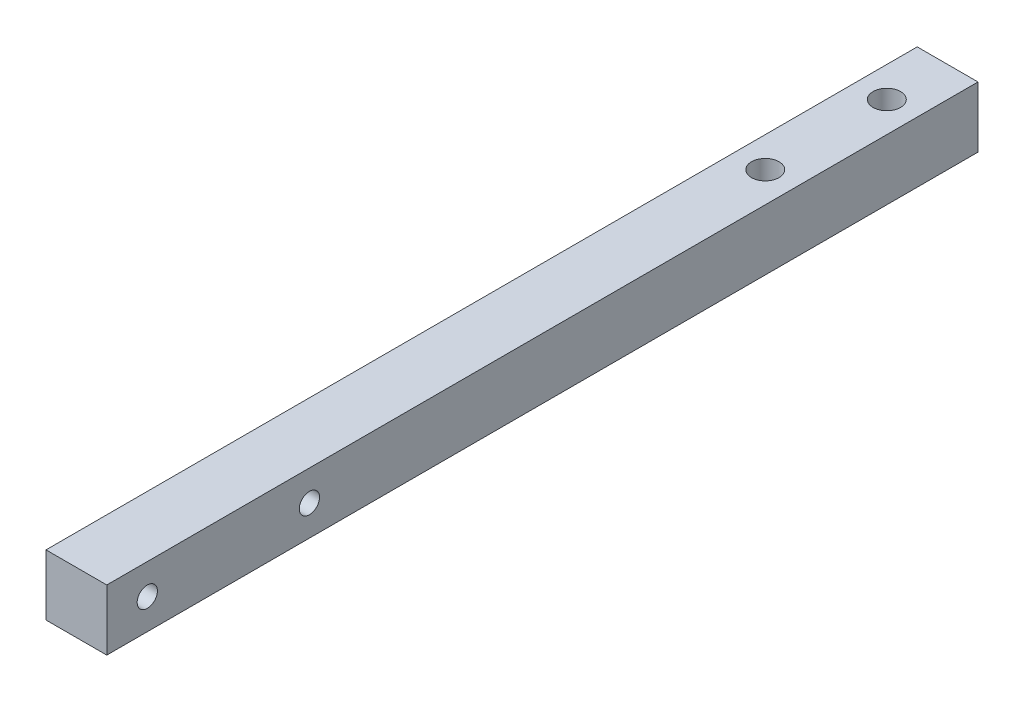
ISO-10303-21;
HEADER;
FILE_DESCRIPTION(('STEP AP214'),'2;1');
FILE_NAME('part.step','',(''),(''),'','','');
FILE_SCHEMA(('AUTOMOTIVE_DESIGN { 1 0 10303 214 1 1 1 1 }'));
ENDSEC;
DATA;
#1=APPLICATION_CONTEXT('core data for automotive mechanical design processes');
#2=APPLICATION_PROTOCOL_DEFINITION('international standard','automotive_design',2000,#1);
#3=PRODUCT_CONTEXT('',#1,'mechanical');
#4=PRODUCT('Part','Part','',(#3));
#5=PRODUCT_RELATED_PRODUCT_CATEGORY('part','',(#4));
#6=PRODUCT_DEFINITION_FORMATION('','',#4);
#7=PRODUCT_DEFINITION_CONTEXT('part definition',#1,'design');
#8=PRODUCT_DEFINITION('design','',#6,#7);
#9=PRODUCT_DEFINITION_SHAPE('','',#8);
#10=(LENGTH_UNIT() NAMED_UNIT(*) SI_UNIT(.MILLI.,.METRE.));
#11=(NAMED_UNIT(*) PLANE_ANGLE_UNIT() SI_UNIT($,.RADIAN.));
#12=(NAMED_UNIT(*) SI_UNIT($,.STERADIAN.) SOLID_ANGLE_UNIT());
#13=UNCERTAINTY_MEASURE_WITH_UNIT(LENGTH_MEASURE(1.E-05),#10,'distance_accuracy_value','');
#14=(GEOMETRIC_REPRESENTATION_CONTEXT(3) GLOBAL_UNCERTAINTY_ASSIGNED_CONTEXT((#13)) GLOBAL_UNIT_ASSIGNED_CONTEXT((#10,
#11,#12)) REPRESENTATION_CONTEXT('',''));
#15=CARTESIAN_POINT('',(0.,0.,0.));
#16=DIRECTION('',(0.,0.,1.));
#17=DIRECTION('',(1.,0.,0.));
#18=AXIS2_PLACEMENT_3D('',#15,#16,#17);
#19=CARTESIAN_POINT('',(-4.71844785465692E-13,-1.88737914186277E-12,215.));
#20=DIRECTION('',(1.,0.,0.));
#21=DIRECTION('',(0.,0.,-1.));
#22=AXIS2_PLACEMENT_3D('',#19,#20,#21);
#23=PLANE('',#22);
#24=CARTESIAN_POINT('',(-4.71844785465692E-13,7.50000000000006,165.));
#25=DIRECTION('',(1.,0.,0.));
#26=DIRECTION('',(0.,0.,-1.));
#27=AXIS2_PLACEMENT_3D('',#24,#25,#26);
#28=CIRCLE('',#27,2.5);
#29=CARTESIAN_POINT('',(-4.71844785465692E-13,7.50000000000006,162.5));
#30=VERTEX_POINT('',#29);
#31=EDGE_CURVE('E153',#30,#30,#28,.T.);
#32=ORIENTED_EDGE('',*,*,#31,.T.);
#33=EDGE_LOOP('',(#32));
#34=FACE_BOUND('',#33,.T.);
#35=CARTESIAN_POINT('',(-4.71844785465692E-13,7.49999999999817,205.));
#36=DIRECTION('',(1.,0.,0.));
#37=DIRECTION('',(0.,0.,-1.));
#38=AXIS2_PLACEMENT_3D('',#35,#36,#37);
#39=CIRCLE('',#38,2.5);
#40=CARTESIAN_POINT('',(-4.71844785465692E-13,7.49999999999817,202.5));
#41=VERTEX_POINT('',#40);
#42=EDGE_CURVE('E106',#41,#41,#39,.T.);
#43=ORIENTED_EDGE('',*,*,#42,.T.);
#44=EDGE_LOOP('',(#43));
#45=FACE_BOUND('',#44,.T.);
#46=DIRECTION('',(0.,-1.,0.));
#47=VECTOR('',#46,1.);
#48=CARTESIAN_POINT('',(-4.71844785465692E-13,0.,0.));
#49=LINE('',#48,#47);
#50=CARTESIAN_POINT('',(-4.71844785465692E-13,15.,0.));
#51=VERTEX_POINT('',#50);
#52=CARTESIAN_POINT('',(-4.71844785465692E-13,0.,0.));
#53=VERTEX_POINT('',#52);
#54=EDGE_CURVE('E85',#51,#53,#49,.T.);
#55=ORIENTED_EDGE('',*,*,#54,.T.);
#56=DIRECTION('',(0.,0.,-1.));
#57=VECTOR('',#56,1.);
#58=CARTESIAN_POINT('',(-4.71844785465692E-13,-1.88737914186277E-12,215.));
#59=LINE('',#58,#57);
#60=CARTESIAN_POINT('',(-4.71844785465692E-13,-1.88737914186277E-12,215.));
#61=VERTEX_POINT('',#60);
#62=EDGE_CURVE('E11',#61,#53,#59,.T.);
#63=ORIENTED_EDGE('',*,*,#62,.F.);
#64=DIRECTION('',(0.,-1.,0.));
#65=VECTOR('',#64,1.);
#66=CARTESIAN_POINT('',(-4.71844785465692E-13,-1.88737914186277E-12,215.));
#67=LINE('',#66,#65);
#68=CARTESIAN_POINT('',(0.,14.9999999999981,215.));
#69=VERTEX_POINT('',#68);
#70=EDGE_CURVE('E115',#69,#61,#67,.T.);
#71=ORIENTED_EDGE('',*,*,#70,.F.);
#72=DIRECTION('',(0.,0.,-1.));
#73=VECTOR('',#72,1.);
#74=CARTESIAN_POINT('',(0.,14.9999999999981,215.));
#75=LINE('',#74,#73);
#76=EDGE_CURVE('E98',#69,#51,#75,.T.);
#77=ORIENTED_EDGE('',*,*,#76,.T.);
#78=EDGE_LOOP('',(#55,#63,#71,#77));
#79=FACE_BOUND('',#78,.T.);
#80=ADVANCED_FACE('F40',(#34,#45,#79),#23,.F.);
#81=CARTESIAN_POINT('',(-4.71844785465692E-13,-1.88737914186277E-12,215.));
#82=DIRECTION('',(0.,1.,0.));
#83=DIRECTION('',(0.,0.,1.));
#84=AXIS2_PLACEMENT_3D('',#81,#82,#83);
#85=PLANE('',#84);
#86=CARTESIAN_POINT('',(7.49999999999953,0.,45.0000000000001));
#87=DIRECTION('',(0.,1.,0.));
#88=DIRECTION('',(0.,0.,1.));
#89=AXIS2_PLACEMENT_3D('',#86,#87,#88);
#90=CIRCLE('',#89,3.4);
#91=CARTESIAN_POINT('',(7.49999999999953,0.,48.4000000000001));
#92=VERTEX_POINT('',#91);
#93=EDGE_CURVE('E176',#92,#92,#90,.T.);
#94=ORIENTED_EDGE('',*,*,#93,.T.);
#95=EDGE_LOOP('',(#94));
#96=FACE_BOUND('',#95,.T.);
#97=CARTESIAN_POINT('',(7.49999999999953,0.,15.0000000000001));
#98=DIRECTION('',(0.,1.,0.));
#99=DIRECTION('',(0.,0.,1.));
#100=AXIS2_PLACEMENT_3D('',#97,#98,#99);
#101=CIRCLE('',#100,3.4);
#102=CARTESIAN_POINT('',(7.49999999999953,0.,18.4000000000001));
#103=VERTEX_POINT('',#102);
#104=EDGE_CURVE('E169',#103,#103,#101,.T.);
#105=ORIENTED_EDGE('',*,*,#104,.T.);
#106=EDGE_LOOP('',(#105));
#107=FACE_BOUND('',#106,.T.);
#108=DIRECTION('',(1.,0.,0.));
#109=VECTOR('',#108,1.);
#110=CARTESIAN_POINT('',(-4.71844785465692E-13,0.,0.));
#111=LINE('',#110,#109);
#112=CARTESIAN_POINT('',(14.9999999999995,0.,0.));
#113=VERTEX_POINT('',#112);
#114=EDGE_CURVE('E81',#53,#113,#111,.T.);
#115=ORIENTED_EDGE('',*,*,#114,.T.);
#116=DIRECTION('',(0.,0.,-1.));
#117=VECTOR('',#116,1.);
#118=CARTESIAN_POINT('',(14.9999999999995,-1.88737914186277E-12,215.));
#119=LINE('',#118,#117);
#120=CARTESIAN_POINT('',(14.9999999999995,-1.88737914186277E-12,215.));
#121=VERTEX_POINT('',#120);
#122=EDGE_CURVE('E48',#121,#113,#119,.T.);
#123=ORIENTED_EDGE('',*,*,#122,.F.);
#124=DIRECTION('',(1.,0.,0.));
#125=VECTOR('',#124,1.);
#126=CARTESIAN_POINT('',(-4.71844785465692E-13,-1.88737914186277E-12,215.));
#127=LINE('',#126,#125);
#128=EDGE_CURVE('E94',#61,#121,#127,.T.);
#129=ORIENTED_EDGE('',*,*,#128,.F.);
#130=ORIENTED_EDGE('',*,*,#62,.T.);
#131=EDGE_LOOP('',(#115,#123,#129,#130));
#132=FACE_BOUND('',#131,.T.);
#133=ADVANCED_FACE('F93',(#96,#107,#132),#85,.F.);
#134=CARTESIAN_POINT('',(14.9999999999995,-1.88737914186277E-12,215.));
#135=DIRECTION('',(-1.,0.,0.));
#136=DIRECTION('',(0.,0.,1.));
#137=AXIS2_PLACEMENT_3D('',#134,#135,#136);
#138=PLANE('',#137);
#139=CARTESIAN_POINT('',(14.9999999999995,7.50000000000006,165.));
#140=DIRECTION('',(1.,0.,0.));
#141=DIRECTION('',(0.,0.,-1.));
#142=AXIS2_PLACEMENT_3D('',#139,#140,#141);
#143=CIRCLE('',#142,2.49999999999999);
#144=CARTESIAN_POINT('',(14.9999999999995,7.50000000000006,162.5));
#145=VERTEX_POINT('',#144);
#146=EDGE_CURVE('E158',#145,#145,#143,.T.);
#147=ORIENTED_EDGE('',*,*,#146,.F.);
#148=EDGE_LOOP('',(#147));
#149=FACE_BOUND('',#148,.T.);
#150=CARTESIAN_POINT('',(14.9999999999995,7.49999999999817,205.));
#151=DIRECTION('',(1.,0.,0.));
#152=DIRECTION('',(0.,0.,-1.));
#153=AXIS2_PLACEMENT_3D('',#150,#151,#152);
#154=CIRCLE('',#153,2.49999999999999);
#155=CARTESIAN_POINT('',(14.9999999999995,7.49999999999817,202.5));
#156=VERTEX_POINT('',#155);
#157=EDGE_CURVE('E100',#156,#156,#154,.T.);
#158=ORIENTED_EDGE('',*,*,#157,.F.);
#159=EDGE_LOOP('',(#158));
#160=FACE_BOUND('',#159,.T.);
#161=DIRECTION('',(0.,1.,0.));
#162=VECTOR('',#161,1.);
#163=CARTESIAN_POINT('',(14.9999999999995,0.,0.));
#164=LINE('',#163,#162);
#165=CARTESIAN_POINT('',(14.9999999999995,15.,0.));
#166=VERTEX_POINT('',#165);
#167=EDGE_CURVE('E86',#113,#166,#164,.T.);
#168=ORIENTED_EDGE('',*,*,#167,.T.);
#169=DIRECTION('',(0.,0.,-1.));
#170=VECTOR('',#169,1.);
#171=CARTESIAN_POINT('',(15.,14.9999999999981,215.));
#172=LINE('',#171,#170);
#173=CARTESIAN_POINT('',(15.,14.9999999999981,215.));
#174=VERTEX_POINT('',#173);
#175=EDGE_CURVE('E126',#174,#166,#172,.T.);
#176=ORIENTED_EDGE('',*,*,#175,.F.);
#177=DIRECTION('',(0.,1.,0.));
#178=VECTOR('',#177,1.);
#179=CARTESIAN_POINT('',(14.9999999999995,-1.88737914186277E-12,215.));
#180=LINE('',#179,#178);
#181=EDGE_CURVE('E60',#121,#174,#180,.T.);
#182=ORIENTED_EDGE('',*,*,#181,.F.);
#183=ORIENTED_EDGE('',*,*,#122,.T.);
#184=EDGE_LOOP('',(#168,#176,#182,#183));
#185=FACE_BOUND('',#184,.T.);
#186=ADVANCED_FACE('F130',(#149,#160,#185),#138,.F.);
#187=CARTESIAN_POINT('',(0.,14.9999999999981,215.));
#188=DIRECTION('',(0.,-1.,0.));
#189=DIRECTION('',(0.,0.,-1.));
#190=AXIS2_PLACEMENT_3D('',#187,#188,#189);
#191=PLANE('',#190);
#192=CARTESIAN_POINT('',(7.49999999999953,15.,45.0000000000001));
#193=DIRECTION('',(0.,1.,0.));
#194=DIRECTION('',(0.,0.,1.));
#195=AXIS2_PLACEMENT_3D('',#192,#193,#194);
#196=CIRCLE('',#195,3.39999999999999);
#197=CARTESIAN_POINT('',(7.49999999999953,15.,48.4000000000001));
#198=VERTEX_POINT('',#197);
#199=EDGE_CURVE('E173',#198,#198,#196,.T.);
#200=ORIENTED_EDGE('',*,*,#199,.F.);
#201=EDGE_LOOP('',(#200));
#202=FACE_BOUND('',#201,.T.);
#203=CARTESIAN_POINT('',(7.49999999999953,15.,15.));
#204=DIRECTION('',(0.,1.,0.));
#205=DIRECTION('',(0.,0.,1.));
#206=AXIS2_PLACEMENT_3D('',#203,#204,#205);
#207=CIRCLE('',#206,3.39999999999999);
#208=CARTESIAN_POINT('',(7.49999999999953,15.,18.4));
#209=VERTEX_POINT('',#208);
#210=EDGE_CURVE('E166',#209,#209,#207,.T.);
#211=ORIENTED_EDGE('',*,*,#210,.F.);
#212=EDGE_LOOP('',(#211));
#213=FACE_BOUND('',#212,.T.);
#214=DIRECTION('',(-1.,0.,0.));
#215=VECTOR('',#214,1.);
#216=CARTESIAN_POINT('',(-4.71844785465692E-13,15.,0.));
#217=LINE('',#216,#215);
#218=EDGE_CURVE('E112',#166,#51,#217,.T.);
#219=ORIENTED_EDGE('',*,*,#218,.T.);
#220=ORIENTED_EDGE('',*,*,#76,.F.);
#221=DIRECTION('',(-1.,0.,0.));
#222=VECTOR('',#221,1.);
#223=CARTESIAN_POINT('',(0.,14.9999999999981,215.));
#224=LINE('',#223,#222);
#225=EDGE_CURVE('E55',#174,#69,#224,.T.);
#226=ORIENTED_EDGE('',*,*,#225,.F.);
#227=ORIENTED_EDGE('',*,*,#175,.T.);
#228=EDGE_LOOP('',(#219,#220,#226,#227));
#229=FACE_BOUND('',#228,.T.);
#230=ADVANCED_FACE('F132',(#202,#213,#229),#191,.F.);
#231=CARTESIAN_POINT('',(0.,14.9999999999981,215.));
#232=DIRECTION('',(0.,0.,-1.));
#233=DIRECTION('',(-1.,0.,0.));
#234=AXIS2_PLACEMENT_3D('',#231,#232,#233);
#235=PLANE('',#234);
#236=ORIENTED_EDGE('',*,*,#70,.T.);
#237=ORIENTED_EDGE('',*,*,#128,.T.);
#238=ORIENTED_EDGE('',*,*,#181,.T.);
#239=ORIENTED_EDGE('',*,*,#225,.T.);
#240=EDGE_LOOP('',(#236,#237,#238,#239));
#241=FACE_BOUND('',#240,.T.);
#242=ADVANCED_FACE('F133',(#241),#235,.F.);
#243=CARTESIAN_POINT('',(-4.71844785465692E-13,15.,0.));
#244=DIRECTION('',(0.,0.,-1.));
#245=DIRECTION('',(-1.,0.,0.));
#246=AXIS2_PLACEMENT_3D('',#243,#244,#245);
#247=PLANE('',#246);
#248=ORIENTED_EDGE('',*,*,#54,.F.);
#249=ORIENTED_EDGE('',*,*,#218,.F.);
#250=ORIENTED_EDGE('',*,*,#167,.F.);
#251=ORIENTED_EDGE('',*,*,#114,.F.);
#252=EDGE_LOOP('',(#248,#249,#250,#251));
#253=FACE_BOUND('',#252,.T.);
#254=ADVANCED_FACE('F82',(#253),#247,.T.);
#255=CARTESIAN_POINT('',(14.9999999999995,7.49999999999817,205.));
#256=DIRECTION('',(1.,0.,0.));
#257=DIRECTION('',(0.,0.,-1.));
#258=AXIS2_PLACEMENT_3D('',#255,#256,#257);
#259=CYLINDRICAL_SURFACE('',#258,2.49999999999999);
#260=ORIENTED_EDGE('',*,*,#42,.F.);
#261=EDGE_LOOP('',(#260));
#262=FACE_BOUND('',#261,.T.);
#263=ORIENTED_EDGE('',*,*,#157,.T.);
#264=EDGE_LOOP('',(#263));
#265=FACE_BOUND('',#264,.T.);
#266=ADVANCED_FACE('F140',(#262,#265),#259,.F.);
#267=CARTESIAN_POINT('',(14.9999999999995,7.50000000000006,165.));
#268=DIRECTION('',(1.,0.,0.));
#269=DIRECTION('',(0.,0.,-1.));
#270=AXIS2_PLACEMENT_3D('',#267,#268,#269);
#271=CYLINDRICAL_SURFACE('',#270,2.49999999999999);
#272=ORIENTED_EDGE('',*,*,#31,.F.);
#273=EDGE_LOOP('',(#272));
#274=FACE_BOUND('',#273,.T.);
#275=ORIENTED_EDGE('',*,*,#146,.T.);
#276=EDGE_LOOP('',(#275));
#277=FACE_BOUND('',#276,.T.);
#278=ADVANCED_FACE('F192',(#274,#277),#271,.F.);
#279=CARTESIAN_POINT('',(7.49999999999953,15.,15.));
#280=DIRECTION('',(0.,1.,0.));
#281=DIRECTION('',(0.,0.,1.));
#282=AXIS2_PLACEMENT_3D('',#279,#280,#281);
#283=CYLINDRICAL_SURFACE('',#282,3.39999999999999);
#284=ORIENTED_EDGE('',*,*,#104,.F.);
#285=EDGE_LOOP('',(#284));
#286=FACE_BOUND('',#285,.T.);
#287=ORIENTED_EDGE('',*,*,#210,.T.);
#288=EDGE_LOOP('',(#287));
#289=FACE_BOUND('',#288,.T.);
#290=ADVANCED_FACE('F185',(#286,#289),#283,.F.);
#291=CARTESIAN_POINT('',(7.49999999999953,15.,45.0000000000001));
#292=DIRECTION('',(0.,1.,0.));
#293=DIRECTION('',(0.,0.,1.));
#294=AXIS2_PLACEMENT_3D('',#291,#292,#293);
#295=CYLINDRICAL_SURFACE('',#294,3.39999999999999);
#296=ORIENTED_EDGE('',*,*,#93,.F.);
#297=EDGE_LOOP('',(#296));
#298=FACE_BOUND('',#297,.T.);
#299=ORIENTED_EDGE('',*,*,#199,.T.);
#300=EDGE_LOOP('',(#299));
#301=FACE_BOUND('',#300,.T.);
#302=ADVANCED_FACE('F182',(#298,#301),#295,.F.);
#303=CLOSED_SHELL('',(#80,#133,#186,#230,#242,#254,#266,#278,#290,#302));
#304=MANIFOLD_SOLID_BREP('B2',#303);
#305=ADVANCED_BREP_SHAPE_REPRESENTATION('',(#18,#304),#14);
#306=SHAPE_DEFINITION_REPRESENTATION(#9,#305);
ENDSEC;
END-ISO-10303-21;
